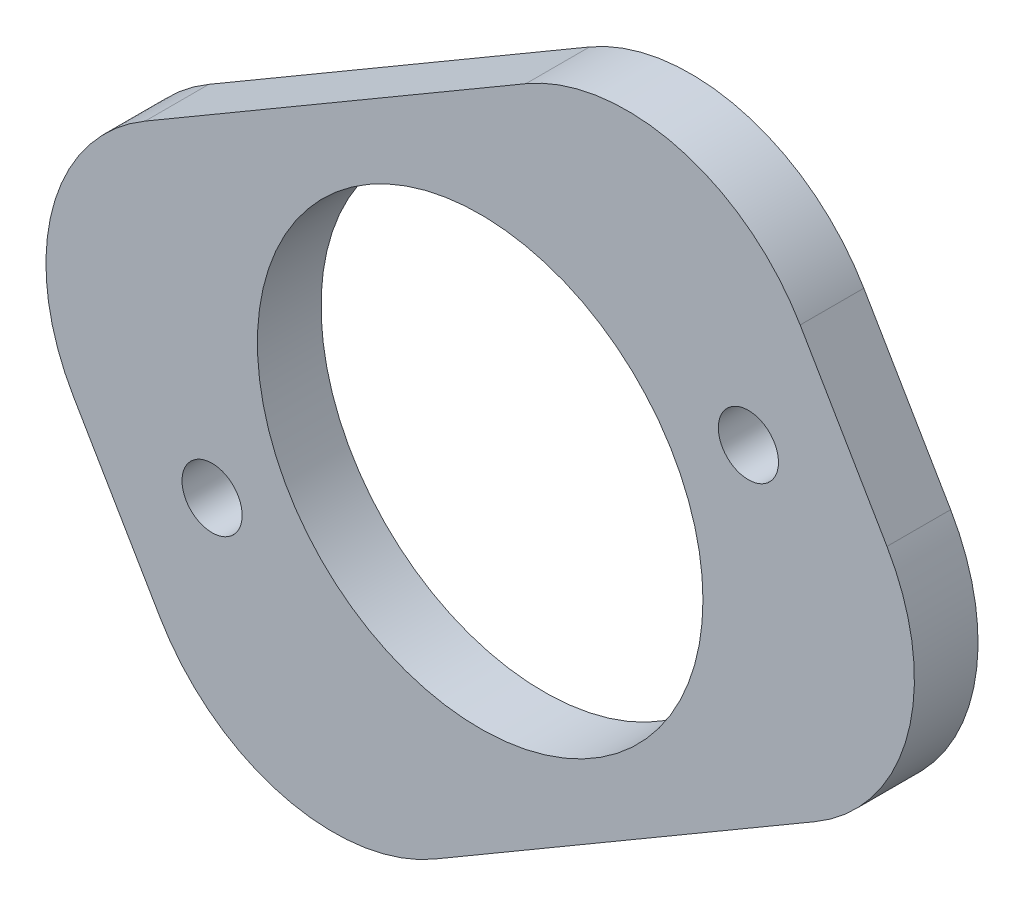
from build123d import *

# Parameters (mm, degrees)
SKETCH1_R           = 11.1125
SKETCH1_R_2         = 1.5
BOSS_EXTRUDE3_DEPTH = 3.175
FILLET1_R           = 10


with BuildPart() as part:
    # Sketch1 → Boss-Extrude3 (new body)
    with BuildSketch(Plane.XY):
        Polygon((-10.180693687, 314.494065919), (-46.432319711, 293.285114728), (-60.861981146, 317.949167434), (-24.610355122, 339.158118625), align=None)
        with Locations((-35.521337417, 316.221616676)):
            Circle(SKETCH1_R, mode=Mode.SUBTRACT)
        with Locations((-22.142761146, 324.048729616)):
            Circle(SKETCH1_R_2, mode=Mode.SUBTRACT)
        with Locations((-48.894533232, 308.38531438)):
            Circle(SKETCH1_R_2, mode=Mode.SUBTRACT)
    extrude(amount=BOSS_EXTRUDE3_DEPTH)

    # Fillet1
    fillet1_edges = [part.edges().sort_by_distance(p)[0] for p in [
        (-10.180693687, 314.494065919, 1.5875),
        (-46.432319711, 293.285114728, 1.5875),
        (-60.861981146, 317.949167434, 1.5875),
        (-24.610355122, 339.158118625, 1.5875),
    ]]
    fillet(fillet1_edges, radius=FILLET1_R)


solid = part.part
